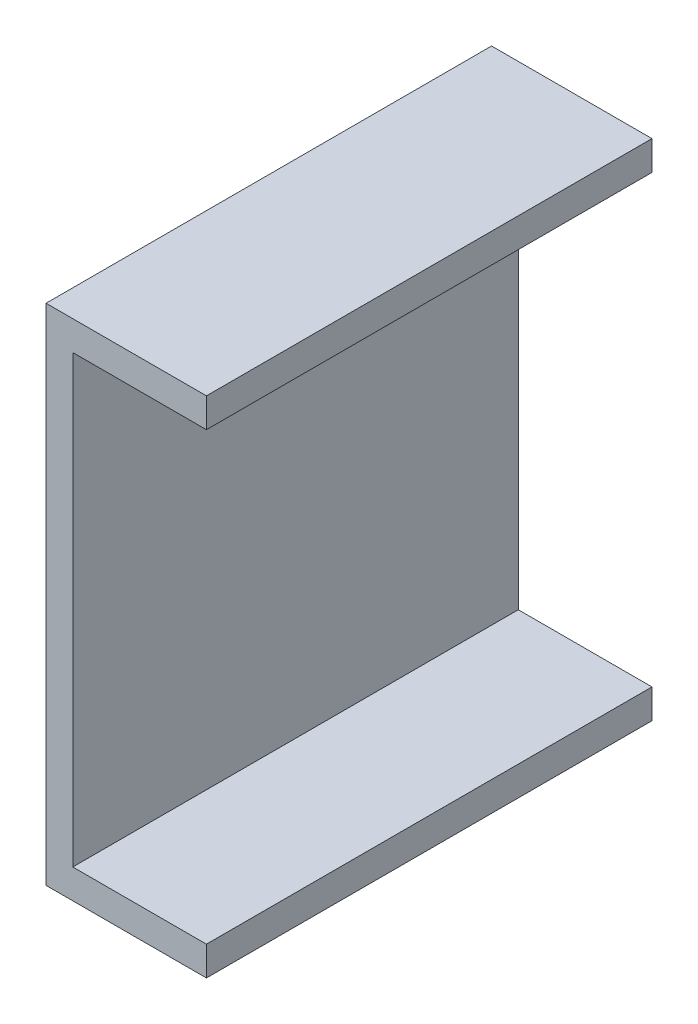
from build123d import *

# Parameters (mm, degrees)
BOSS_EXTRUDE1_DEPTH = 50


with BuildPart() as part:
    # Sketch3 → Boss-Extrude1 (new body)
    with BuildSketch(Plane.XY):
        Polygon((101.695580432, 33.897884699), (86.695580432, 33.897884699), (83.695580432, 33.897884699), (83.695580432, -22.681791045), (86.695580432, -22.681791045), (101.695580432, -22.681791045), (101.695580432, -19.391791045), (86.695580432, -19.391791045), (86.695580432, 30.608208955), (101.695580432, 30.608208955), align=None)
    extrude(amount=BOSS_EXTRUDE1_DEPTH)


solid = part.part
